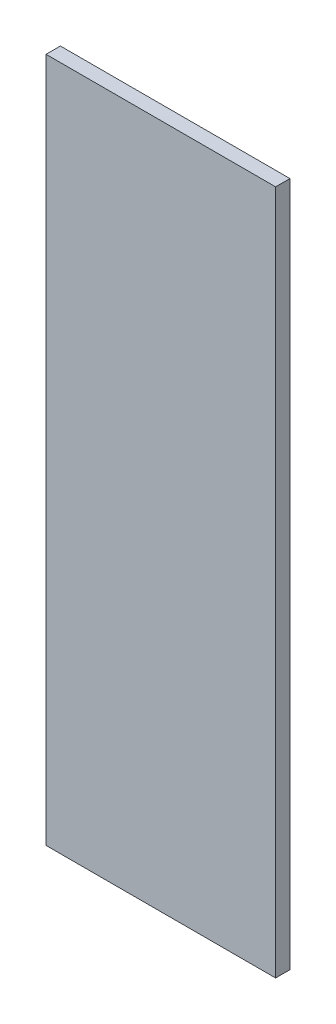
ISO-10303-21;
HEADER;
FILE_DESCRIPTION(('STEP AP214'),'2;1');
FILE_NAME('part.step','',(''),(''),'','','');
FILE_SCHEMA(('AUTOMOTIVE_DESIGN { 1 0 10303 214 1 1 1 1 }'));
ENDSEC;
DATA;
#1=APPLICATION_CONTEXT('core data for automotive mechanical design processes');
#2=APPLICATION_PROTOCOL_DEFINITION('international standard','automotive_design',2000,#1);
#3=PRODUCT_CONTEXT('',#1,'mechanical');
#4=PRODUCT('Part','Part','',(#3));
#5=PRODUCT_RELATED_PRODUCT_CATEGORY('part','',(#4));
#6=PRODUCT_DEFINITION_FORMATION('','',#4);
#7=PRODUCT_DEFINITION_CONTEXT('part definition',#1,'design');
#8=PRODUCT_DEFINITION('design','',#6,#7);
#9=PRODUCT_DEFINITION_SHAPE('','',#8);
#10=(LENGTH_UNIT() NAMED_UNIT(*) SI_UNIT(.MILLI.,.METRE.));
#11=(NAMED_UNIT(*) PLANE_ANGLE_UNIT() SI_UNIT($,.RADIAN.));
#12=(NAMED_UNIT(*) SI_UNIT($,.STERADIAN.) SOLID_ANGLE_UNIT());
#13=UNCERTAINTY_MEASURE_WITH_UNIT(LENGTH_MEASURE(1.E-05),#10,'distance_accuracy_value','');
#14=(GEOMETRIC_REPRESENTATION_CONTEXT(3) GLOBAL_UNCERTAINTY_ASSIGNED_CONTEXT((#13)) GLOBAL_UNIT_ASSIGNED_CONTEXT((#10,
#11,#12)) REPRESENTATION_CONTEXT('',''));
#15=CARTESIAN_POINT('',(0.,0.,0.));
#16=DIRECTION('',(0.,0.,1.));
#17=DIRECTION('',(1.,0.,0.));
#18=AXIS2_PLACEMENT_3D('',#15,#16,#17);
#19=CARTESIAN_POINT('',(-101.6,303.2125,12.7));
#20=DIRECTION('',(1.,0.,0.));
#21=DIRECTION('',(0.,1.,0.));
#22=AXIS2_PLACEMENT_3D('',#19,#20,#21);
#23=PLANE('',#22);
#24=DIRECTION('',(0.,-1.,0.));
#25=VECTOR('',#24,1.);
#26=CARTESIAN_POINT('',(-101.6,303.2125,0.));
#27=LINE('',#26,#25);
#28=CARTESIAN_POINT('',(-101.6,303.2125,0.));
#29=VERTEX_POINT('',#28);
#30=CARTESIAN_POINT('',(-101.6,-303.2125,0.));
#31=VERTEX_POINT('',#30);
#32=EDGE_CURVE('E96',#29,#31,#27,.T.);
#33=ORIENTED_EDGE('',*,*,#32,.T.);
#34=DIRECTION('',(0.,0.,-1.));
#35=VECTOR('',#34,1.);
#36=CARTESIAN_POINT('',(-101.6,-303.2125,12.7));
#37=LINE('',#36,#35);
#38=CARTESIAN_POINT('',(-101.6,-303.2125,12.7));
#39=VERTEX_POINT('',#38);
#40=EDGE_CURVE('E11',#39,#31,#37,.T.);
#41=ORIENTED_EDGE('',*,*,#40,.F.);
#42=DIRECTION('',(0.,-1.,0.));
#43=VECTOR('',#42,1.);
#44=CARTESIAN_POINT('',(-101.6,303.2125,12.7));
#45=LINE('',#44,#43);
#46=CARTESIAN_POINT('',(-101.6,303.2125,12.7));
#47=VERTEX_POINT('',#46);
#48=EDGE_CURVE('E84',#47,#39,#45,.T.);
#49=ORIENTED_EDGE('',*,*,#48,.F.);
#50=DIRECTION('',(0.,0.,-1.));
#51=VECTOR('',#50,1.);
#52=CARTESIAN_POINT('',(-101.6,303.2125,12.7));
#53=LINE('',#52,#51);
#54=EDGE_CURVE('E92',#47,#29,#53,.T.);
#55=ORIENTED_EDGE('',*,*,#54,.T.);
#56=EDGE_LOOP('',(#33,#41,#49,#55));
#57=FACE_BOUND('',#56,.T.);
#58=ADVANCED_FACE('F33',(#57),#23,.F.);
#59=CARTESIAN_POINT('',(-101.6,-303.2125,12.7));
#60=DIRECTION('',(0.,1.,0.));
#61=DIRECTION('',(0.,0.,1.));
#62=AXIS2_PLACEMENT_3D('',#59,#60,#61);
#63=PLANE('',#62);
#64=DIRECTION('',(1.,0.,0.));
#65=VECTOR('',#64,1.);
#66=CARTESIAN_POINT('',(-101.6,-303.2125,0.));
#67=LINE('',#66,#65);
#68=CARTESIAN_POINT('',(101.6,-303.2125,0.));
#69=VERTEX_POINT('',#68);
#70=EDGE_CURVE('E88',#31,#69,#67,.T.);
#71=ORIENTED_EDGE('',*,*,#70,.T.);
#72=DIRECTION('',(0.,0.,-1.));
#73=VECTOR('',#72,1.);
#74=CARTESIAN_POINT('',(101.6,-303.2125,12.7));
#75=LINE('',#74,#73);
#76=CARTESIAN_POINT('',(101.6,-303.2125,12.7));
#77=VERTEX_POINT('',#76);
#78=EDGE_CURVE('E41',#77,#69,#75,.T.);
#79=ORIENTED_EDGE('',*,*,#78,.F.);
#80=DIRECTION('',(1.,0.,0.));
#81=VECTOR('',#80,1.);
#82=CARTESIAN_POINT('',(-101.6,-303.2125,12.7));
#83=LINE('',#82,#81);
#84=EDGE_CURVE('E79',#39,#77,#83,.T.);
#85=ORIENTED_EDGE('',*,*,#84,.F.);
#86=ORIENTED_EDGE('',*,*,#40,.T.);
#87=EDGE_LOOP('',(#71,#79,#85,#86));
#88=FACE_BOUND('',#87,.T.);
#89=ADVANCED_FACE('F87',(#88),#63,.F.);
#90=CARTESIAN_POINT('',(101.6,303.2125,12.7));
#91=DIRECTION('',(-1.,0.,0.));
#92=DIRECTION('',(0.,-1.,0.));
#93=AXIS2_PLACEMENT_3D('',#90,#91,#92);
#94=PLANE('',#93);
#95=DIRECTION('',(0.,1.,0.));
#96=VECTOR('',#95,1.);
#97=CARTESIAN_POINT('',(101.6,303.2125,0.));
#98=LINE('',#97,#96);
#99=CARTESIAN_POINT('',(101.6,303.2125,0.));
#100=VERTEX_POINT('',#99);
#101=EDGE_CURVE('E66',#69,#100,#98,.T.);
#102=ORIENTED_EDGE('',*,*,#101,.T.);
#103=DIRECTION('',(0.,0.,-1.));
#104=VECTOR('',#103,1.);
#105=CARTESIAN_POINT('',(101.6,303.2125,12.7));
#106=LINE('',#105,#104);
#107=CARTESIAN_POINT('',(101.6,303.2125,12.7));
#108=VERTEX_POINT('',#107);
#109=EDGE_CURVE('E89',#108,#100,#106,.T.);
#110=ORIENTED_EDGE('',*,*,#109,.F.);
#111=DIRECTION('',(0.,1.,0.));
#112=VECTOR('',#111,1.);
#113=CARTESIAN_POINT('',(101.6,303.2125,12.7));
#114=LINE('',#113,#112);
#115=EDGE_CURVE('E82',#77,#108,#114,.T.);
#116=ORIENTED_EDGE('',*,*,#115,.F.);
#117=ORIENTED_EDGE('',*,*,#78,.T.);
#118=EDGE_LOOP('',(#102,#110,#116,#117));
#119=FACE_BOUND('',#118,.T.);
#120=ADVANCED_FACE('F90',(#119),#94,.F.);
#121=CARTESIAN_POINT('',(-101.6,303.2125,12.7));
#122=DIRECTION('',(0.,-1.,0.));
#123=DIRECTION('',(0.,0.,-1.));
#124=AXIS2_PLACEMENT_3D('',#121,#122,#123);
#125=PLANE('',#124);
#126=DIRECTION('',(-1.,0.,0.));
#127=VECTOR('',#126,1.);
#128=CARTESIAN_POINT('',(-101.6,303.2125,0.));
#129=LINE('',#128,#127);
#130=EDGE_CURVE('E72',#100,#29,#129,.T.);
#131=ORIENTED_EDGE('',*,*,#130,.T.);
#132=ORIENTED_EDGE('',*,*,#54,.F.);
#133=DIRECTION('',(-1.,0.,0.));
#134=VECTOR('',#133,1.);
#135=CARTESIAN_POINT('',(-101.6,303.2125,12.7));
#136=LINE('',#135,#134);
#137=EDGE_CURVE('E49',#108,#47,#136,.T.);
#138=ORIENTED_EDGE('',*,*,#137,.F.);
#139=ORIENTED_EDGE('',*,*,#109,.T.);
#140=EDGE_LOOP('',(#131,#132,#138,#139));
#141=FACE_BOUND('',#140,.T.);
#142=ADVANCED_FACE('F103',(#141),#125,.F.);
#143=CARTESIAN_POINT('',(-101.6,-303.2125,12.7));
#144=DIRECTION('',(0.,0.,1.));
#145=DIRECTION('',(1.,0.,0.));
#146=AXIS2_PLACEMENT_3D('',#143,#144,#145);
#147=PLANE('',#146);
#148=ORIENTED_EDGE('',*,*,#48,.T.);
#149=ORIENTED_EDGE('',*,*,#84,.T.);
#150=ORIENTED_EDGE('',*,*,#115,.T.);
#151=ORIENTED_EDGE('',*,*,#137,.T.);
#152=EDGE_LOOP('',(#148,#149,#150,#151));
#153=FACE_BOUND('',#152,.T.);
#154=ADVANCED_FACE('F80',(#153),#147,.T.);
#155=CARTESIAN_POINT('',(-101.6,-303.2125,0.));
#156=DIRECTION('',(0.,0.,1.));
#157=DIRECTION('',(1.,0.,0.));
#158=AXIS2_PLACEMENT_3D('',#155,#156,#157);
#159=PLANE('',#158);
#160=ORIENTED_EDGE('',*,*,#32,.F.);
#161=ORIENTED_EDGE('',*,*,#130,.F.);
#162=ORIENTED_EDGE('',*,*,#101,.F.);
#163=ORIENTED_EDGE('',*,*,#70,.F.);
#164=EDGE_LOOP('',(#160,#161,#162,#163));
#165=FACE_BOUND('',#164,.T.);
#166=ADVANCED_FACE('F106',(#165),#159,.F.);
#167=CLOSED_SHELL('',(#58,#89,#120,#142,#154,#166));
#168=MANIFOLD_SOLID_BREP('B2',#167);
#169=ADVANCED_BREP_SHAPE_REPRESENTATION('',(#18,#168),#14);
#170=SHAPE_DEFINITION_REPRESENTATION(#9,#169);
ENDSEC;
END-ISO-10303-21;
